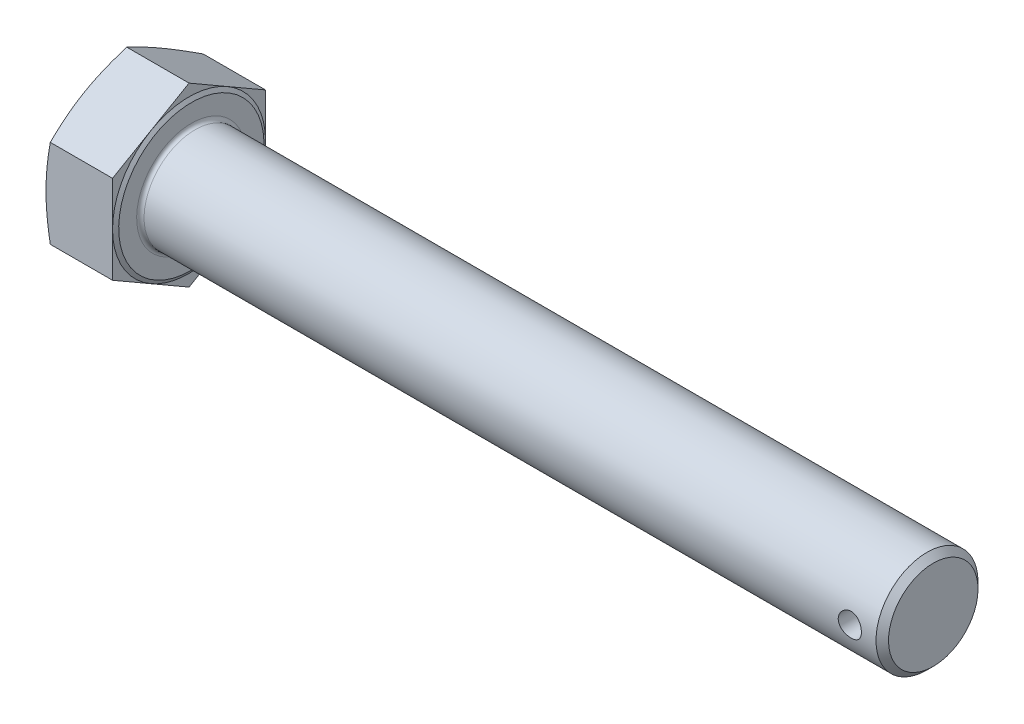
ISO-10303-21;
HEADER;
FILE_DESCRIPTION(('STEP AP214'),'2;1');
FILE_NAME('part.step','',(''),(''),'','','');
FILE_SCHEMA(('AUTOMOTIVE_DESIGN { 1 0 10303 214 1 1 1 1 }'));
ENDSEC;
DATA;
#1=APPLICATION_CONTEXT('core data for automotive mechanical design processes');
#2=APPLICATION_PROTOCOL_DEFINITION('international standard','automotive_design',2000,#1);
#3=PRODUCT_CONTEXT('',#1,'mechanical');
#4=PRODUCT('Part','Part','',(#3));
#5=PRODUCT_RELATED_PRODUCT_CATEGORY('part','',(#4));
#6=PRODUCT_DEFINITION_FORMATION('','',#4);
#7=PRODUCT_DEFINITION_CONTEXT('part definition',#1,'design');
#8=PRODUCT_DEFINITION('design','',#6,#7);
#9=PRODUCT_DEFINITION_SHAPE('','',#8);
#10=(LENGTH_UNIT() NAMED_UNIT(*) SI_UNIT(.MILLI.,.METRE.));
#11=(NAMED_UNIT(*) PLANE_ANGLE_UNIT() SI_UNIT($,.RADIAN.));
#12=(NAMED_UNIT(*) SI_UNIT($,.STERADIAN.) SOLID_ANGLE_UNIT());
#13=UNCERTAINTY_MEASURE_WITH_UNIT(LENGTH_MEASURE(1.E-05),#10,'distance_accuracy_value','');
#14=(GEOMETRIC_REPRESENTATION_CONTEXT(3) GLOBAL_UNCERTAINTY_ASSIGNED_CONTEXT((#13)) GLOBAL_UNIT_ASSIGNED_CONTEXT((#10,
#11,#12)) REPRESENTATION_CONTEXT('',''));
#15=CARTESIAN_POINT('',(0.,0.,0.));
#16=DIRECTION('',(0.,0.,1.));
#17=DIRECTION('',(1.,0.,0.));
#18=AXIS2_PLACEMENT_3D('',#15,#16,#17);
#19=CARTESIAN_POINT('',(14.85,0.,0.));
#20=DIRECTION('',(-1.,0.,0.));
#21=DIRECTION('',(0.,-1.,0.));
#22=AXIS2_PLACEMENT_3D('',#19,#20,#21);
#23=PLANE('',#22);
#24=CARTESIAN_POINT('',(14.85,0.,0.));
#25=DIRECTION('',(-1.,0.,0.));
#26=DIRECTION('',(0.,-1.,0.));
#27=AXIS2_PLACEMENT_3D('',#24,#25,#26);
#28=CIRCLE('',#27,11.8);
#29=CARTESIAN_POINT('',(14.85,-11.8,0.));
#30=VERTEX_POINT('',#29);
#31=EDGE_CURVE('E11',#30,#30,#28,.T.);
#32=ORIENTED_EDGE('',*,*,#31,.T.);
#33=EDGE_LOOP('',(#32));
#34=FACE_BOUND('',#33,.T.);
#35=CARTESIAN_POINT('',(14.85,0.,0.));
#36=DIRECTION('',(-1.,0.,0.));
#37=DIRECTION('',(0.,-1.,0.));
#38=AXIS2_PLACEMENT_3D('',#35,#36,#37);
#39=CIRCLE('',#38,15.675);
#40=CARTESIAN_POINT('',(14.85,-15.675,0.));
#41=VERTEX_POINT('',#40);
#42=EDGE_CURVE('E145',#41,#41,#39,.T.);
#43=ORIENTED_EDGE('',*,*,#42,.F.);
#44=EDGE_LOOP('',(#43));
#45=FACE_BOUND('',#44,.T.);
#46=ADVANCED_FACE('F32',(#34,#45),#23,.F.);
#47=CARTESIAN_POINT('',(14.35,-28.5788383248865,-16.5));
#48=DIRECTION('',(1.,0.,0.));
#49=DIRECTION('',(0.,0.,-1.));
#50=AXIS2_PLACEMENT_3D('',#47,#48,#49);
#51=PLANE('',#50);
#52=DIRECTION('',(0.,-0.5,-0.866025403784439));
#53=VECTOR('',#52,1.);
#54=CARTESIAN_POINT('',(14.35,-9.52627944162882,16.5));
#55=LINE('',#54,#53);
#56=CARTESIAN_POINT('',(14.35,-9.52627944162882,16.5));
#57=VERTEX_POINT('',#56);
#58=CARTESIAN_POINT('',(14.35,-14.2894191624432,8.25));
#59=VERTEX_POINT('',#58);
#60=EDGE_CURVE('E144',#57,#59,#55,.T.);
#61=ORIENTED_EDGE('',*,*,#60,.T.);
#62=CARTESIAN_POINT('',(14.35,0.,0.));
#63=DIRECTION('',(-1.,0.,0.));
#64=DIRECTION('',(0.,-1.,0.));
#65=AXIS2_PLACEMENT_3D('',#62,#63,#64);
#66=CIRCLE('',#65,16.5);
#67=CARTESIAN_POINT('',(14.35,0.,16.5));
#68=VERTEX_POINT('',#67);
#69=EDGE_CURVE('E54',#59,#68,#66,.T.);
#70=ORIENTED_EDGE('',*,*,#69,.T.);
#71=DIRECTION('',(0.,-1.,0.));
#72=VECTOR('',#71,1.);
#73=CARTESIAN_POINT('',(14.35,9.52627944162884,16.5));
#74=LINE('',#73,#72);
#75=EDGE_CURVE('E141',#68,#57,#74,.T.);
#76=ORIENTED_EDGE('',*,*,#75,.T.);
#77=EDGE_LOOP('',(#61,#70,#76));
#78=FACE_BOUND('',#77,.T.);
#79=ADVANCED_FACE('F140',(#78),#51,.T.);
#80=CARTESIAN_POINT('',(14.35,9.52627944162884,16.5));
#81=VERTEX_POINT('',#80);
#82=EDGE_CURVE('E152',#81,#68,#74,.T.);
#83=ORIENTED_EDGE('',*,*,#82,.T.);
#84=CARTESIAN_POINT('',(14.35,14.2894191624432,8.25));
#85=VERTEX_POINT('',#84);
#86=EDGE_CURVE('E127',#68,#85,#66,.T.);
#87=ORIENTED_EDGE('',*,*,#86,.T.);
#88=DIRECTION('',(0.,-0.5,0.866025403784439));
#89=VECTOR('',#88,1.);
#90=CARTESIAN_POINT('',(14.35,19.0525588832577,0.));
#91=LINE('',#90,#89);
#92=EDGE_CURVE('E158',#85,#81,#91,.T.);
#93=ORIENTED_EDGE('',*,*,#92,.T.);
#94=EDGE_LOOP('',(#83,#87,#93));
#95=FACE_BOUND('',#94,.T.);
#96=ADVANCED_FACE('F157',(#95),#51,.T.);
#97=CARTESIAN_POINT('',(14.35,19.0525588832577,0.));
#98=VERTEX_POINT('',#97);
#99=EDGE_CURVE('E155',#98,#85,#91,.T.);
#100=ORIENTED_EDGE('',*,*,#99,.T.);
#101=CARTESIAN_POINT('',(14.35,14.2894191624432,-8.25));
#102=VERTEX_POINT('',#101);
#103=EDGE_CURVE('E131',#85,#102,#66,.T.);
#104=ORIENTED_EDGE('',*,*,#103,.T.);
#105=DIRECTION('',(0.,0.5,0.866025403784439));
#106=VECTOR('',#105,1.);
#107=CARTESIAN_POINT('',(14.35,9.52627944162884,-16.5));
#108=LINE('',#107,#106);
#109=EDGE_CURVE('E324',#102,#98,#108,.T.);
#110=ORIENTED_EDGE('',*,*,#109,.T.);
#111=EDGE_LOOP('',(#100,#104,#110));
#112=FACE_BOUND('',#111,.T.);
#113=ADVANCED_FACE('F336',(#112),#51,.T.);
#114=CARTESIAN_POINT('',(14.35,9.52627944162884,-16.5));
#115=VERTEX_POINT('',#114);
#116=EDGE_CURVE('E326',#115,#102,#108,.T.);
#117=ORIENTED_EDGE('',*,*,#116,.T.);
#118=CARTESIAN_POINT('',(14.35,0.,-16.5));
#119=VERTEX_POINT('',#118);
#120=EDGE_CURVE('E379',#102,#119,#66,.T.);
#121=ORIENTED_EDGE('',*,*,#120,.T.);
#122=DIRECTION('',(0.,1.,0.));
#123=VECTOR('',#122,1.);
#124=CARTESIAN_POINT('',(14.35,-9.52627944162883,-16.5));
#125=LINE('',#124,#123);
#126=EDGE_CURVE('E321',#119,#115,#125,.T.);
#127=ORIENTED_EDGE('',*,*,#126,.T.);
#128=EDGE_LOOP('',(#117,#121,#127));
#129=FACE_BOUND('',#128,.T.);
#130=ADVANCED_FACE('F380',(#129),#51,.T.);
#131=CARTESIAN_POINT('',(14.35,-9.52627944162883,-16.5));
#132=VERTEX_POINT('',#131);
#133=EDGE_CURVE('E319',#132,#119,#125,.T.);
#134=ORIENTED_EDGE('',*,*,#133,.T.);
#135=CARTESIAN_POINT('',(14.35,-14.2894191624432,-8.24999999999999));
#136=VERTEX_POINT('',#135);
#137=EDGE_CURVE('E363',#119,#136,#66,.T.);
#138=ORIENTED_EDGE('',*,*,#137,.T.);
#139=DIRECTION('',(0.,0.5,-0.866025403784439));
#140=VECTOR('',#139,1.);
#141=CARTESIAN_POINT('',(14.35,-19.0525588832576,0.));
#142=LINE('',#141,#140);
#143=EDGE_CURVE('E377',#136,#132,#142,.T.);
#144=ORIENTED_EDGE('',*,*,#143,.T.);
#145=EDGE_LOOP('',(#134,#138,#144));
#146=FACE_BOUND('',#145,.T.);
#147=ADVANCED_FACE('F378',(#146),#51,.T.);
#148=CARTESIAN_POINT('',(14.35,-19.0525588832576,0.));
#149=VERTEX_POINT('',#148);
#150=EDGE_CURVE('E327',#149,#136,#142,.T.);
#151=ORIENTED_EDGE('',*,*,#150,.T.);
#152=EDGE_CURVE('E146',#136,#59,#66,.T.);
#153=ORIENTED_EDGE('',*,*,#152,.T.);
#154=EDGE_CURVE('E372',#59,#149,#55,.T.);
#155=ORIENTED_EDGE('',*,*,#154,.T.);
#156=EDGE_LOOP('',(#151,#153,#155));
#157=FACE_BOUND('',#156,.T.);
#158=ADVANCED_FACE('F224',(#157),#51,.T.);
#159=CARTESIAN_POINT('',(14.35,-9.52627944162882,16.5));
#160=DIRECTION('',(0.,0.866025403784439,-0.5));
#161=DIRECTION('',(0.,0.5,0.866025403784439));
#162=AXIS2_PLACEMENT_3D('',#159,#160,#161);
#163=PLANE('',#162);
#164=CARTESIAN_POINT('',(0.929097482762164,-19.0526743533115,-0.000199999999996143));
#165=CARTESIAN_POINT('',(0.857296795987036,-18.8553899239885,0.341506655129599));
#166=CARTESIAN_POINT('',(0.788725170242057,-18.6578155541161,0.683715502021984));
#167=CARTESIAN_POINT('',(0.658750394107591,-18.2620600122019,1.36918420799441));
#168=CARTESIAN_POINT('',(0.597347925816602,-18.0638787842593,1.71244416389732));
#169=CARTESIAN_POINT('',(0.424900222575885,-17.4681663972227,2.74424828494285));
#170=CARTESIAN_POINT('',(0.325715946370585,-17.0697392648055,3.43434432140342));
#171=CARTESIAN_POINT('',(0.205175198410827,-16.4725985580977,4.46862236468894));
#172=CARTESIAN_POINT('',(0.169803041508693,-16.2745739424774,4.81161106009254));
#173=CARTESIAN_POINT('',(0.108718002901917,-15.8781549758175,5.49822885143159));
#174=CARTESIAN_POINT('',(0.0830047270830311,-15.6797606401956,5.84185792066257));
#175=CARTESIAN_POINT('',(0.0416866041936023,-15.2827766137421,6.5294544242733));
#176=CARTESIAN_POINT('',(0.0260782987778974,-15.0841870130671,6.87342170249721));
#177=CARTESIAN_POINT('',(0.00523501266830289,-14.6868713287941,7.56159265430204));
#178=CARTESIAN_POINT('',(0.,-14.4881452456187,7.90579632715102));
#179=CARTESIAN_POINT('',(0.,-14.0906930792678,8.59420367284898));
#180=CARTESIAN_POINT('',(0.00523501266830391,-13.8919669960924,8.93840734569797));
#181=CARTESIAN_POINT('',(0.026078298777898,-13.4946513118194,9.62657829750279));
#182=CARTESIAN_POINT('',(0.041686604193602,-13.2960617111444,9.97054557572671));
#183=CARTESIAN_POINT('',(0.0830047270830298,-12.8990776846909,10.6581420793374));
#184=CARTESIAN_POINT('',(0.108718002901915,-12.700683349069,11.0017711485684));
#185=CARTESIAN_POINT('',(0.169803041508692,-12.304264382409,11.6883889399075));
#186=CARTESIAN_POINT('',(0.205175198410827,-12.1062397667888,12.0313776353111));
#187=CARTESIAN_POINT('',(0.325715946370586,-11.5090990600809,13.0656556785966));
#188=CARTESIAN_POINT('',(0.424900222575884,-11.1106719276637,13.7557517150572));
#189=CARTESIAN_POINT('',(0.597347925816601,-10.5149595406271,14.7875558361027));
#190=CARTESIAN_POINT('',(0.658750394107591,-10.3167783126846,15.1308157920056));
#191=CARTESIAN_POINT('',(0.788725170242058,-9.92102277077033,15.816284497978));
#192=CARTESIAN_POINT('',(0.857296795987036,-9.72344840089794,16.1584933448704));
#193=CARTESIAN_POINT('',(0.929097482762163,-9.52616397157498,16.5002));
#194=B_SPLINE_CURVE_WITH_KNOTS('',3,(#164,#165,#166,#167,#168,#169,#170,#171,#172,#173,#174,
#175,#176,#177,#178,#179,#180,#181,#182,#183,#184,#185,#186,#187,#188,#189,#190,#191,#192,#193),
.UNSPECIFIED.,.F.,.F.,(4,2,2,2,2,2,2,2,2,2,2,2,2,2,4),(0.,1.20310984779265,2.40633407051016,
4.8144458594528,6.00722883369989,7.19996313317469,8.39228901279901,9.58461121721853,
10.776933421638,11.9692593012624,13.1619936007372,14.3547765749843,16.7628883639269,
17.9661125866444,19.1692224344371),.UNSPECIFIED.);
#195=CARTESIAN_POINT('',(0.92905545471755,-19.0525588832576,0.));
#196=VERTEX_POINT('',#195);
#197=CARTESIAN_POINT('',(0.,-14.2894191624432,8.24999999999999));
#198=VERTEX_POINT('',#197);
#199=EDGE_CURVE('E366',#196,#198,#194,.T.);
#200=ORIENTED_EDGE('',*,*,#199,.F.);
#201=DIRECTION('',(-1.,0.,0.));
#202=VECTOR('',#201,1.);
#203=CARTESIAN_POINT('',(14.35,-19.0525588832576,0.));
#204=LINE('',#203,#202);
#205=EDGE_CURVE('E175',#149,#196,#204,.T.);
#206=ORIENTED_EDGE('',*,*,#205,.F.);
#207=ORIENTED_EDGE('',*,*,#154,.F.);
#208=ORIENTED_EDGE('',*,*,#60,.F.);
#209=DIRECTION('',(-1.,0.,0.));
#210=VECTOR('',#209,1.);
#211=CARTESIAN_POINT('',(14.35,-9.52627944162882,16.5));
#212=LINE('',#211,#210);
#213=CARTESIAN_POINT('',(0.929055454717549,-9.52627944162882,16.5));
#214=VERTEX_POINT('',#213);
#215=EDGE_CURVE('E154',#57,#214,#212,.T.);
#216=ORIENTED_EDGE('',*,*,#215,.T.);
#217=EDGE_CURVE('E256',#198,#214,#194,.T.);
#218=ORIENTED_EDGE('',*,*,#217,.F.);
#219=EDGE_LOOP('',(#200,#206,#207,#208,#216,#218));
#220=FACE_BOUND('',#219,.T.);
#221=ADVANCED_FACE('F34',(#220),#163,.F.);
#222=CARTESIAN_POINT('',(14.35,-19.0525588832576,0.));
#223=DIRECTION('',(0.,0.866025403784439,0.5));
#224=DIRECTION('',(0.,-0.5,0.866025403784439));
#225=AXIS2_PLACEMENT_3D('',#222,#223,#224);
#226=PLANE('',#225);
#227=CARTESIAN_POINT('',(0.929097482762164,-9.52616397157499,-16.5002));
#228=CARTESIAN_POINT('',(0.857296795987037,-9.72344840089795,-16.1584933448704));
#229=CARTESIAN_POINT('',(0.788725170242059,-9.92102277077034,-15.816284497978));
#230=CARTESIAN_POINT('',(0.658750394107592,-10.3167783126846,-15.1308157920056));
#231=CARTESIAN_POINT('',(0.597347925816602,-10.5149595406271,-14.7875558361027));
#232=CARTESIAN_POINT('',(0.424900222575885,-11.1106719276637,-13.7557517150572));
#233=CARTESIAN_POINT('',(0.325715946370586,-11.5090990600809,-13.0656556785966));
#234=CARTESIAN_POINT('',(0.205175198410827,-12.1062397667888,-12.0313776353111));
#235=CARTESIAN_POINT('',(0.169803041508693,-12.304264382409,-11.6883889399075));
#236=CARTESIAN_POINT('',(0.108718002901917,-12.700683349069,-11.0017711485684));
#237=CARTESIAN_POINT('',(0.0830047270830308,-12.8990776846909,-10.6581420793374));
#238=CARTESIAN_POINT('',(0.0416866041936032,-13.2960617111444,-9.97054557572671));
#239=CARTESIAN_POINT('',(0.0260782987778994,-13.4946513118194,-9.62657829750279));
#240=CARTESIAN_POINT('',(0.00523501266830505,-13.8919669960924,-8.93840734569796));
#241=CARTESIAN_POINT('',(0.,-14.0906930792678,-8.59420367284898));
#242=CARTESIAN_POINT('',(0.,-14.4881452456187,-7.90579632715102));
#243=CARTESIAN_POINT('',(0.00523501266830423,-14.6868713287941,-7.56159265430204));
#244=CARTESIAN_POINT('',(0.0260782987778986,-15.0841870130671,-6.87342170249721));
#245=CARTESIAN_POINT('',(0.0416866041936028,-15.2827766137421,-6.52945442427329));
#246=CARTESIAN_POINT('',(0.0830047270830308,-15.6797606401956,-5.84185792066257));
#247=CARTESIAN_POINT('',(0.108718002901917,-15.8781549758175,-5.49822885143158));
#248=CARTESIAN_POINT('',(0.169803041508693,-16.2745739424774,-4.81161106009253));
#249=CARTESIAN_POINT('',(0.205175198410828,-16.4725985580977,-4.46862236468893));
#250=CARTESIAN_POINT('',(0.325715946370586,-17.0697392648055,-3.43434432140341));
#251=CARTESIAN_POINT('',(0.424900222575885,-17.4681663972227,-2.74424828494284));
#252=CARTESIAN_POINT('',(0.597347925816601,-18.0638787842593,-1.71244416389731));
#253=CARTESIAN_POINT('',(0.658750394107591,-18.2620600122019,-1.3691842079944));
#254=CARTESIAN_POINT('',(0.788725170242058,-18.6578155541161,-0.683715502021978));
#255=CARTESIAN_POINT('',(0.857296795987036,-18.8553899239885,-0.341506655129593));
#256=CARTESIAN_POINT('',(0.929097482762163,-19.0526743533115,0.000200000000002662));
#257=B_SPLINE_CURVE_WITH_KNOTS('',3,(#227,#228,#229,#230,#231,#232,#233,#234,#235,#236,#237,
#238,#239,#240,#241,#242,#243,#244,#245,#246,#247,#248,#249,#250,#251,#252,#253,#254,#255,#256),
.UNSPECIFIED.,.F.,.F.,(4,2,2,2,2,2,2,2,2,2,2,2,2,2,4),(0.,1.20310984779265,2.40633407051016,
4.8144458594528,6.00722883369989,7.19996313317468,8.39228901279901,9.58461121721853,
10.776933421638,11.9692593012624,13.1619936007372,14.3547765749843,16.7628883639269,
17.9661125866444,19.1692224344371),.UNSPECIFIED.);
#258=CARTESIAN_POINT('',(0.929055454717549,-9.52627944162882,-16.5));
#259=VERTEX_POINT('',#258);
#260=CARTESIAN_POINT('',(0.,-14.2894191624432,-8.24999999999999));
#261=VERTEX_POINT('',#260);
#262=EDGE_CURVE('E270',#259,#261,#257,.T.);
#263=ORIENTED_EDGE('',*,*,#262,.F.);
#264=DIRECTION('',(-1.,0.,0.));
#265=VECTOR('',#264,1.);
#266=CARTESIAN_POINT('',(14.35,-9.52627944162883,-16.5));
#267=LINE('',#266,#265);
#268=EDGE_CURVE('E172',#132,#259,#267,.T.);
#269=ORIENTED_EDGE('',*,*,#268,.F.);
#270=ORIENTED_EDGE('',*,*,#143,.F.);
#271=ORIENTED_EDGE('',*,*,#150,.F.);
#272=ORIENTED_EDGE('',*,*,#205,.T.);
#273=EDGE_CURVE('E266',#261,#196,#257,.T.);
#274=ORIENTED_EDGE('',*,*,#273,.F.);
#275=EDGE_LOOP('',(#263,#269,#270,#271,#272,#274));
#276=FACE_BOUND('',#275,.T.);
#277=ADVANCED_FACE('F277',(#276),#226,.F.);
#278=CARTESIAN_POINT('',(14.35,-9.52627944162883,-16.5));
#279=DIRECTION('',(0.,0.,1.));
#280=DIRECTION('',(1.,0.,0.));
#281=AXIS2_PLACEMENT_3D('',#278,#279,#280);
#282=PLANE('',#281);
#283=CARTESIAN_POINT('',(4.96450390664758,-25.2222382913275,-16.5));
#284=CARTESIAN_POINT('',(4.8508186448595,-24.8489839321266,-16.5));
#285=CARTESIAN_POINT('',(4.73782089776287,-24.4755202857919,-16.5));
#286=CARTESIAN_POINT('',(4.51335434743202,-23.7281315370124,-16.5));
#287=CARTESIAN_POINT('',(4.40188555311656,-23.3542064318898,-16.5));
#288=CARTESIAN_POINT('',(4.06998909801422,-22.2316258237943,-16.5));
#289=CARTESIAN_POINT('',(3.85208821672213,-21.4822201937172,-16.5));
#290=CARTESIAN_POINT('',(3.42417782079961,-19.9796417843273,-16.5));
#291=CARTESIAN_POINT('',(3.21418378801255,-19.2264645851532,-16.5));
#292=CARTESIAN_POINT('',(2.80452755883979,-17.7173088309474,-16.5));
#293=CARTESIAN_POINT('',(2.60486517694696,-16.961330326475,-16.5));
#294=CARTESIAN_POINT('',(2.22081902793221,-15.4554094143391,-16.5));
#295=CARTESIAN_POINT('',(2.0362772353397,-14.7055075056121,-16.5));
#296=CARTESIAN_POINT('',(1.68290492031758,-13.201972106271,-16.5));
#297=CARTESIAN_POINT('',(1.51407466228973,-12.4483385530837,-16.5));
#298=CARTESIAN_POINT('',(1.19606187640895,-10.9371711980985,-16.5));
#299=CARTESIAN_POINT('',(1.04687264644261,-10.1796388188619,-16.5));
#300=CARTESIAN_POINT('',(0.77268459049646,-8.66017606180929,-16.5));
#301=CARTESIAN_POINT('',(0.647684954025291,-7.89824583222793,-16.5));
#302=CARTESIAN_POINT('',(0.439330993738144,-6.45578370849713,-16.5));
#303=CARTESIAN_POINT('',(0.352878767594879,-5.77570349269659,-16.5));
#304=CARTESIAN_POINT('',(0.206535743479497,-4.41266734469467,-16.5));
#305=CARTESIAN_POINT('',(0.14664417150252,-3.72971149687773,-16.5));
#306=CARTESIAN_POINT('',(0.0563067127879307,-2.36230937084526,-16.5));
#307=CARTESIAN_POINT('',(0.0258399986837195,-1.67786449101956,-16.5));
#308=CARTESIAN_POINT('',(-0.00410522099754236,-0.308289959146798,-16.5));
#309=CARTESIAN_POINT('',(-0.00358394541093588,0.376839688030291,-16.5));
#310=CARTESIAN_POINT('',(0.0284996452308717,1.74983625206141,-16.5));
#311=CARTESIAN_POINT('',(0.0602193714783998,2.43769942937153,-16.5));
#312=CARTESIAN_POINT('',(0.153240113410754,3.81140535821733,-16.5));
#313=CARTESIAN_POINT('',(0.214541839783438,4.49724806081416,-16.5));
#314=CARTESIAN_POINT('',(0.36385891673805,5.86657438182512,-16.5));
#315=CARTESIAN_POINT('',(0.451897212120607,6.55005546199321,-16.5));
#316=CARTESIAN_POINT('',(0.651116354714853,7.91359833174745,-16.5));
#317=CARTESIAN_POINT('',(0.76229732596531,8.59366010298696,-16.5));
#318=CARTESIAN_POINT('',(1.01058110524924,9.98615039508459,-16.5));
#319=CARTESIAN_POINT('',(1.1487439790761,10.6983882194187,-16.5));
#320=CARTESIAN_POINT('',(1.4428521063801,12.1192063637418,-16.5));
#321=CARTESIAN_POINT('',(1.59879870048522,12.8277864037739,-16.5));
#322=CARTESIAN_POINT('',(1.92519971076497,14.2417939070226,-16.5));
#323=CARTESIAN_POINT('',(2.09565834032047,14.9472203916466,-16.5));
#324=CARTESIAN_POINT('',(2.44831056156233,16.3551017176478,-16.5));
#325=CARTESIAN_POINT('',(2.63050387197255,17.0575566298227,-16.5));
#326=CARTESIAN_POINT('',(3.00467207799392,18.4608135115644,-16.5));
#327=CARTESIAN_POINT('',(3.19665923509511,19.1616121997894,-16.5));
#328=CARTESIAN_POINT('',(3.58844340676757,20.5610201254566,-16.5));
#329=CARTESIAN_POINT('',(3.78824045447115,21.2596293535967,-16.5));
#330=CARTESIAN_POINT('',(4.19421484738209,22.6548603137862,-16.5));
#331=CARTESIAN_POINT('',(4.40039111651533,23.3514823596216,-16.5));
#332=CARTESIAN_POINT('',(4.818047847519,24.7431302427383,-16.5));
#333=CARTESIAN_POINT('',(5.02952829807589,25.4381560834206,-16.5));
#334=CARTESIAN_POINT('',(5.45454897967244,26.8191789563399,-16.5));
#335=CARTESIAN_POINT('',(5.66804068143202,27.5051909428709,-16.5));
#336=CARTESIAN_POINT('',(6.09866542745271,28.8760718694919,-16.5));
#337=CARTESIAN_POINT('',(6.31579848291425,29.5609408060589,-16.5));
#338=CARTESIAN_POINT('',(6.97181459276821,31.6141379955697,-16.5));
#339=CARTESIAN_POINT('',(7.41529632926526,32.980997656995,-16.5));
#340=CARTESIAN_POINT('',(8.08638638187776,35.0264823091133,-16.5));
#341=CARTESIAN_POINT('',(8.31062765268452,35.706217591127,-16.5));
#342=CARTESIAN_POINT('',(8.76104960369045,37.0650463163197,-16.5));
#343=CARTESIAN_POINT('',(8.98723028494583,37.744139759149,-16.5));
#344=CARTESIAN_POINT('',(9.44125199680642,39.1017090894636,-16.5));
#345=CARTESIAN_POINT('',(9.66909288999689,39.7801850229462,-16.5));
#346=CARTESIAN_POINT('',(10.1262489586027,41.1366382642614,-16.5));
#347=CARTESIAN_POINT('',(10.3555641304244,41.8146155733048,-16.5));
#348=CARTESIAN_POINT('',(10.5855148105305,42.4923768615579,-16.5));
#349=B_SPLINE_CURVE_WITH_KNOTS('',3,(#283,#284,#285,#286,#287,#288,#289,#290,#291,#292,#293,
#294,#295,#296,#297,#298,#299,#300,#301,#302,#303,#304,#305,#306,#307,#308,#309,#310,#311,#312,
#313,#314,#315,#316,#317,#318,#319,#320,#321,#322,#323,#324,#325,#326,#327,#328,#329,#330,#331,
#332,#333,#334,#335,#336,#337,#338,#339,#340,#341,#342,#343,#344,#345,#346,#347,#348),
.UNSPECIFIED.,.F.,.F.,(4,2,2,2,2,2,2,2,2,2,2,2,2,2,2,2,2,2,2,2,2,2,2,2,2,2,2,2,2,2,2,2,4),(0.,
1.17054922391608,2.34110527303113,4.68239041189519,7.02804380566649,9.37365506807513,
11.6903461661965,14.0070762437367,16.3230137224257,18.6388735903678,20.6950814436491,
22.7512293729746,24.8059208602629,26.8605978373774,28.925695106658,30.9908419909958,
33.0577661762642,35.1247014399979,37.3009674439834,39.4773976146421,41.6544618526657,
43.8314739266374,46.0112818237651,48.1910989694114,50.3705503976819,52.5499971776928,
54.7053784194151,56.8607662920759,61.1717272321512,63.3190307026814,65.4663353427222,
67.6134642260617,69.7605878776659),.UNSPECIFIED.);
#350=CARTESIAN_POINT('',(0.929055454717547,9.52627944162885,-16.5));
#351=VERTEX_POINT('',#350);
#352=CARTESIAN_POINT('',(0.,0.,-16.5));
#353=VERTEX_POINT('',#352);
#354=EDGE_CURVE('E311',#351,#353,#349,.F.);
#355=ORIENTED_EDGE('',*,*,#354,.F.);
#356=DIRECTION('',(-1.,0.,0.));
#357=VECTOR('',#356,1.);
#358=CARTESIAN_POINT('',(14.35,9.52627944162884,-16.5));
#359=LINE('',#358,#357);
#360=EDGE_CURVE('E169',#115,#351,#359,.T.);
#361=ORIENTED_EDGE('',*,*,#360,.F.);
#362=ORIENTED_EDGE('',*,*,#126,.F.);
#363=ORIENTED_EDGE('',*,*,#133,.F.);
#364=ORIENTED_EDGE('',*,*,#268,.T.);
#365=EDGE_CURVE('E271',#353,#259,#349,.F.);
#366=ORIENTED_EDGE('',*,*,#365,.F.);
#367=EDGE_LOOP('',(#355,#361,#362,#363,#364,#366));
#368=FACE_BOUND('',#367,.T.);
#369=ADVANCED_FACE('F280',(#368),#282,.F.);
#370=CARTESIAN_POINT('',(14.35,9.52627944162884,-16.5));
#371=DIRECTION('',(0.,-0.866025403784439,0.5));
#372=DIRECTION('',(0.,-0.5,-0.866025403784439));
#373=AXIS2_PLACEMENT_3D('',#370,#371,#372);
#374=PLANE('',#373);
#375=CARTESIAN_POINT('',(0.92909748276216,19.0526743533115,0.000199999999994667));
#376=CARTESIAN_POINT('',(0.857296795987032,18.8553899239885,-0.341506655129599));
#377=CARTESIAN_POINT('',(0.788725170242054,18.6578155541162,-0.683715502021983));
#378=CARTESIAN_POINT('',(0.658750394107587,18.2620600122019,-1.36918420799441));
#379=CARTESIAN_POINT('',(0.597347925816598,18.0638787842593,-1.71244416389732));
#380=CARTESIAN_POINT('',(0.424900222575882,17.4681663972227,-2.74424828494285));
#381=CARTESIAN_POINT('',(0.325715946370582,17.0697392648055,-3.43434432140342));
#382=CARTESIAN_POINT('',(0.205175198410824,16.4725985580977,-4.46862236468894));
#383=CARTESIAN_POINT('',(0.16980304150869,16.2745739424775,-4.81161106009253));
#384=CARTESIAN_POINT('',(0.108718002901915,15.8781549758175,-5.49822885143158));
#385=CARTESIAN_POINT('',(0.0830047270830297,15.6797606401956,-5.84185792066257));
#386=CARTESIAN_POINT('',(0.0416866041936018,15.2827766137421,-6.52945442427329));
#387=CARTESIAN_POINT('',(0.0260782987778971,15.0841870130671,-6.87342170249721));
#388=CARTESIAN_POINT('',(0.00523501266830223,14.6868713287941,-7.56159265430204));
#389=CARTESIAN_POINT('',(0.,14.4881452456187,-7.90579632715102));
#390=CARTESIAN_POINT('',(0.,14.0906930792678,-8.59420367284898));
#391=CARTESIAN_POINT('',(0.00523501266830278,13.8919669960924,-8.93840734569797));
#392=CARTESIAN_POINT('',(0.0260782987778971,13.4946513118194,-9.62657829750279));
#393=CARTESIAN_POINT('',(0.041686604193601,13.2960617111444,-9.97054557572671));
#394=CARTESIAN_POINT('',(0.0830047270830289,12.8990776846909,-10.6581420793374));
#395=CARTESIAN_POINT('',(0.108718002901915,12.700683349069,-11.0017711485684));
#396=CARTESIAN_POINT('',(0.169803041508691,12.304264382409,-11.6883889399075));
#397=CARTESIAN_POINT('',(0.205175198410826,12.1062397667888,-12.0313776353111));
#398=CARTESIAN_POINT('',(0.325715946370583,11.509099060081,-13.0656556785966));
#399=CARTESIAN_POINT('',(0.424900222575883,11.1106719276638,-13.7557517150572));
#400=CARTESIAN_POINT('',(0.5973479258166,10.5149595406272,-14.7875558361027));
#401=CARTESIAN_POINT('',(0.65875039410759,10.3167783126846,-15.1308157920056));
#402=CARTESIAN_POINT('',(0.788725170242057,9.92102277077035,-15.816284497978));
#403=CARTESIAN_POINT('',(0.857296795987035,9.72344840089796,-16.1584933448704));
#404=CARTESIAN_POINT('',(0.929097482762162,9.526163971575,-16.5002));
#405=B_SPLINE_CURVE_WITH_KNOTS('',3,(#375,#376,#377,#378,#379,#380,#381,#382,#383,#384,#385,
#386,#387,#388,#389,#390,#391,#392,#393,#394,#395,#396,#397,#398,#399,#400,#401,#402,#403,#404),
.UNSPECIFIED.,.F.,.F.,(4,2,2,2,2,2,2,2,2,2,2,2,2,2,4),(0.,1.20310984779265,2.40633407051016,
4.8144458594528,6.00722883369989,7.19996313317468,8.39228901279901,9.58461121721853,
10.776933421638,11.9692593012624,13.1619936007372,14.3547765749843,16.7628883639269,
17.9661125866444,19.1692224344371),.UNSPECIFIED.);
#406=CARTESIAN_POINT('',(0.929055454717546,19.0525588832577,0.));
#407=VERTEX_POINT('',#406);
#408=CARTESIAN_POINT('',(0.,14.2894191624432,-8.25));
#409=VERTEX_POINT('',#408);
#410=EDGE_CURVE('E62',#407,#409,#405,.T.);
#411=ORIENTED_EDGE('',*,*,#410,.F.);
#412=DIRECTION('',(-1.,0.,0.));
#413=VECTOR('',#412,1.);
#414=CARTESIAN_POINT('',(14.35,19.0525588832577,0.));
#415=LINE('',#414,#413);
#416=EDGE_CURVE('E166',#98,#407,#415,.T.);
#417=ORIENTED_EDGE('',*,*,#416,.F.);
#418=ORIENTED_EDGE('',*,*,#109,.F.);
#419=ORIENTED_EDGE('',*,*,#116,.F.);
#420=ORIENTED_EDGE('',*,*,#360,.T.);
#421=EDGE_CURVE('E312',#409,#351,#405,.T.);
#422=ORIENTED_EDGE('',*,*,#421,.F.);
#423=EDGE_LOOP('',(#411,#417,#418,#419,#420,#422));
#424=FACE_BOUND('',#423,.T.);
#425=ADVANCED_FACE('F284',(#424),#374,.F.);
#426=CARTESIAN_POINT('',(14.35,19.0525588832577,0.));
#427=DIRECTION('',(0.,-0.866025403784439,-0.5));
#428=DIRECTION('',(0.,0.5,-0.866025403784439));
#429=AXIS2_PLACEMENT_3D('',#426,#427,#428);
#430=PLANE('',#429);
#431=CARTESIAN_POINT('',(0.929097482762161,9.526163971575,16.5002));
#432=CARTESIAN_POINT('',(0.857296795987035,9.72344840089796,16.1584933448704));
#433=CARTESIAN_POINT('',(0.788725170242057,9.92102277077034,15.816284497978));
#434=CARTESIAN_POINT('',(0.658750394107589,10.3167783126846,15.1308157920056));
#435=CARTESIAN_POINT('',(0.597347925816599,10.5149595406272,14.7875558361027));
#436=CARTESIAN_POINT('',(0.424900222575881,11.1106719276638,13.7557517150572));
#437=CARTESIAN_POINT('',(0.325715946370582,11.509099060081,13.0656556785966));
#438=CARTESIAN_POINT('',(0.205175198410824,12.1062397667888,12.0313776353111));
#439=CARTESIAN_POINT('',(0.169803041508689,12.304264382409,11.6883889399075));
#440=CARTESIAN_POINT('',(0.108718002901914,12.700683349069,11.0017711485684));
#441=CARTESIAN_POINT('',(0.0830047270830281,12.8990776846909,10.6581420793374));
#442=CARTESIAN_POINT('',(0.0416866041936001,13.2960617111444,9.97054557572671));
#443=CARTESIAN_POINT('',(0.0260782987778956,13.4946513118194,9.62657829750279));
#444=CARTESIAN_POINT('',(0.0052350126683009,13.8919669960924,8.93840734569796));
#445=CARTESIAN_POINT('',(0.,14.0906930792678,8.59420367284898));
#446=CARTESIAN_POINT('',(0.,14.4881452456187,7.90579632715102));
#447=CARTESIAN_POINT('',(0.00523501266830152,14.6868713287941,7.56159265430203));
#448=CARTESIAN_POINT('',(0.0260782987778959,15.0841870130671,6.87342170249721));
#449=CARTESIAN_POINT('',(0.0416866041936,15.2827766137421,6.52945442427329));
#450=CARTESIAN_POINT('',(0.0830047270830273,15.6797606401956,5.84185792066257));
#451=CARTESIAN_POINT('',(0.108718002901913,15.8781549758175,5.49822885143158));
#452=CARTESIAN_POINT('',(0.169803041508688,16.2745739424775,4.81161106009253));
#453=CARTESIAN_POINT('',(0.205175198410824,16.4725985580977,4.46862236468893));
#454=CARTESIAN_POINT('',(0.325715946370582,17.0697392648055,3.43434432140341));
#455=CARTESIAN_POINT('',(0.424900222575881,17.4681663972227,2.74424828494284));
#456=CARTESIAN_POINT('',(0.597347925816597,18.0638787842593,1.71244416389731));
#457=CARTESIAN_POINT('',(0.658750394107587,18.2620600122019,1.3691842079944));
#458=CARTESIAN_POINT('',(0.788725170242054,18.6578155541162,0.683715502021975));
#459=CARTESIAN_POINT('',(0.857296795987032,18.8553899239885,0.34150665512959));
#460=CARTESIAN_POINT('',(0.929097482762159,19.0526743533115,-0.000200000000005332));
#461=B_SPLINE_CURVE_WITH_KNOTS('',3,(#431,#432,#433,#434,#435,#436,#437,#438,#439,#440,#441,
#442,#443,#444,#445,#446,#447,#448,#449,#450,#451,#452,#453,#454,#455,#456,#457,#458,#459,#460),
.UNSPECIFIED.,.F.,.F.,(4,2,2,2,2,2,2,2,2,2,2,2,2,2,4),(0.,1.20310984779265,2.40633407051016,
4.81444585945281,6.00722883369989,7.19996313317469,8.39228901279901,9.58461121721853,
10.7769334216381,11.9692593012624,13.1619936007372,14.3547765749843,16.7628883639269,
17.9661125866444,19.1692224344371),.UNSPECIFIED.);
#462=CARTESIAN_POINT('',(0.929055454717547,9.52627944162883,16.5));
#463=VERTEX_POINT('',#462);
#464=CARTESIAN_POINT('',(0.,14.2894191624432,8.24999999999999));
#465=VERTEX_POINT('',#464);
#466=EDGE_CURVE('E249',#463,#465,#461,.T.);
#467=ORIENTED_EDGE('',*,*,#466,.F.);
#468=DIRECTION('',(-1.,0.,0.));
#469=VECTOR('',#468,1.);
#470=CARTESIAN_POINT('',(14.35,9.52627944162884,16.5));
#471=LINE('',#470,#469);
#472=EDGE_CURVE('E160',#81,#463,#471,.T.);
#473=ORIENTED_EDGE('',*,*,#472,.F.);
#474=ORIENTED_EDGE('',*,*,#92,.F.);
#475=ORIENTED_EDGE('',*,*,#99,.F.);
#476=ORIENTED_EDGE('',*,*,#416,.T.);
#477=EDGE_CURVE('E371',#465,#407,#461,.T.);
#478=ORIENTED_EDGE('',*,*,#477,.F.);
#479=EDGE_LOOP('',(#467,#473,#474,#475,#476,#478));
#480=FACE_BOUND('',#479,.T.);
#481=ADVANCED_FACE('F288',(#480),#430,.F.);
#482=CARTESIAN_POINT('',(14.35,9.52627944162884,16.5));
#483=DIRECTION('',(0.,0.,-1.));
#484=DIRECTION('',(-1.,0.,0.));
#485=AXIS2_PLACEMENT_3D('',#482,#483,#484);
#486=PLANE('',#485);
#487=CARTESIAN_POINT('',(4.96450390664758,-25.2222382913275,16.5));
#488=CARTESIAN_POINT('',(4.8508186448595,-24.8489839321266,16.5));
#489=CARTESIAN_POINT('',(4.73782089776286,-24.4755202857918,16.5));
#490=CARTESIAN_POINT('',(4.51335434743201,-23.7281315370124,16.5));
#491=CARTESIAN_POINT('',(4.40188555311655,-23.3542064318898,16.5));
#492=CARTESIAN_POINT('',(4.06998909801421,-22.2316258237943,16.5));
#493=CARTESIAN_POINT('',(3.85208821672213,-21.4822201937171,16.5));
#494=CARTESIAN_POINT('',(3.42417782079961,-19.9796417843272,16.5));
#495=CARTESIAN_POINT('',(3.21418378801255,-19.2264645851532,16.5));
#496=CARTESIAN_POINT('',(2.80452755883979,-17.7173088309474,16.5));
#497=CARTESIAN_POINT('',(2.60486517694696,-16.961330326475,16.5));
#498=CARTESIAN_POINT('',(2.22081902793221,-15.4554094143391,16.5));
#499=CARTESIAN_POINT('',(2.0362772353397,-14.7055075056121,16.5));
#500=CARTESIAN_POINT('',(1.68290492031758,-13.201972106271,16.5));
#501=CARTESIAN_POINT('',(1.51407466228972,-12.4483385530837,16.5));
#502=CARTESIAN_POINT('',(1.19606187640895,-10.9371711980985,16.5));
#503=CARTESIAN_POINT('',(1.04687264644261,-10.1796388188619,16.5));
#504=CARTESIAN_POINT('',(0.772684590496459,-8.66017606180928,16.5));
#505=CARTESIAN_POINT('',(0.64768495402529,-7.89824583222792,16.5));
#506=CARTESIAN_POINT('',(0.439330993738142,-6.45578370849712,16.5));
#507=CARTESIAN_POINT('',(0.352878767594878,-5.77570349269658,16.5));
#508=CARTESIAN_POINT('',(0.206535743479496,-4.41266734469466,16.5));
#509=CARTESIAN_POINT('',(0.14664417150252,-3.72971149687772,16.5));
#510=CARTESIAN_POINT('',(0.0563067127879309,-2.36230937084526,16.5));
#511=CARTESIAN_POINT('',(0.0258399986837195,-1.67786449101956,16.5));
#512=CARTESIAN_POINT('',(-0.00410522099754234,-0.308289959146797,16.5));
#513=CARTESIAN_POINT('',(-0.00358394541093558,0.376839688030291,16.5));
#514=CARTESIAN_POINT('',(0.0284996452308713,1.74983625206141,16.5));
#515=CARTESIAN_POINT('',(0.0602193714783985,2.43769942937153,16.5));
#516=CARTESIAN_POINT('',(0.153240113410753,3.81140535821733,16.5));
#517=CARTESIAN_POINT('',(0.214541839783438,4.49724806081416,16.5));
#518=CARTESIAN_POINT('',(0.36385891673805,5.86657438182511,16.5));
#519=CARTESIAN_POINT('',(0.451897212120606,6.55005546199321,16.5));
#520=CARTESIAN_POINT('',(0.651116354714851,7.91359833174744,16.5));
#521=CARTESIAN_POINT('',(0.762297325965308,8.59366010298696,16.5));
#522=CARTESIAN_POINT('',(1.01058110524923,9.98615039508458,16.5));
#523=CARTESIAN_POINT('',(1.1487439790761,10.6983882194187,16.5));
#524=CARTESIAN_POINT('',(1.44285210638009,12.1192063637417,16.5));
#525=CARTESIAN_POINT('',(1.59879870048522,12.8277864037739,16.5));
#526=CARTESIAN_POINT('',(1.92519971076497,14.2417939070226,16.5));
#527=CARTESIAN_POINT('',(2.09565834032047,14.9472203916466,16.5));
#528=CARTESIAN_POINT('',(2.44831056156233,16.3551017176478,16.5));
#529=CARTESIAN_POINT('',(2.63050387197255,17.0575566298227,16.5));
#530=CARTESIAN_POINT('',(3.00467207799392,18.4608135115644,16.5));
#531=CARTESIAN_POINT('',(3.19665923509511,19.1616121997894,16.5));
#532=CARTESIAN_POINT('',(3.58844340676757,20.5610201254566,16.5));
#533=CARTESIAN_POINT('',(3.78824045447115,21.2596293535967,16.5));
#534=CARTESIAN_POINT('',(4.19421484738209,22.6548603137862,16.5));
#535=CARTESIAN_POINT('',(4.40039111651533,23.3514823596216,16.5));
#536=CARTESIAN_POINT('',(4.818047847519,24.7431302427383,16.5));
#537=CARTESIAN_POINT('',(5.02952829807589,25.4381560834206,16.5));
#538=CARTESIAN_POINT('',(5.45454897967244,26.8191789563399,16.5));
#539=CARTESIAN_POINT('',(5.66804068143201,27.5051909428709,16.5));
#540=CARTESIAN_POINT('',(6.09866542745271,28.8760718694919,16.5));
#541=CARTESIAN_POINT('',(6.31579848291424,29.5609408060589,16.5));
#542=CARTESIAN_POINT('',(6.9718145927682,31.6141379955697,16.5));
#543=CARTESIAN_POINT('',(7.41529632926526,32.980997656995,16.5));
#544=CARTESIAN_POINT('',(8.08638638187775,35.0264823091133,16.5));
#545=CARTESIAN_POINT('',(8.31062765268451,35.706217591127,16.5));
#546=CARTESIAN_POINT('',(8.76104960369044,37.0650463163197,16.5));
#547=CARTESIAN_POINT('',(8.98723028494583,37.744139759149,16.5));
#548=CARTESIAN_POINT('',(9.44125199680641,39.1017090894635,16.5));
#549=CARTESIAN_POINT('',(9.66909288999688,39.7801850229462,16.5));
#550=CARTESIAN_POINT('',(10.1262489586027,41.1366382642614,16.5));
#551=CARTESIAN_POINT('',(10.3555641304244,41.8146155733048,16.5));
#552=CARTESIAN_POINT('',(10.5855148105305,42.4923768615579,16.5));
#553=B_SPLINE_CURVE_WITH_KNOTS('',3,(#487,#488,#489,#490,#491,#492,#493,#494,#495,#496,#497,
#498,#499,#500,#501,#502,#503,#504,#505,#506,#507,#508,#509,#510,#511,#512,#513,#514,#515,#516,
#517,#518,#519,#520,#521,#522,#523,#524,#525,#526,#527,#528,#529,#530,#531,#532,#533,#534,#535,
#536,#537,#538,#539,#540,#541,#542,#543,#544,#545,#546,#547,#548,#549,#550,#551,#552),
.UNSPECIFIED.,.F.,.F.,(4,2,2,2,2,2,2,2,2,2,2,2,2,2,2,2,2,2,2,2,2,2,2,2,2,2,2,2,2,2,2,2,4),(0.,
1.17054922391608,2.34110527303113,4.68239041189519,7.02804380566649,9.37365506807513,
11.6903461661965,14.0070762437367,16.3230137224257,18.6388735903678,20.6950814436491,
22.7512293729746,24.8059208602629,26.8605978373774,28.925695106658,30.9908419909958,
33.0577661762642,35.1247014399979,37.3009674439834,39.4773976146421,41.6544618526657,
43.8314739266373,46.0112818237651,48.1910989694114,50.3705503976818,52.5499971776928,
54.7053784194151,56.8607662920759,61.1717272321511,63.3190307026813,65.4663353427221,
67.6134642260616,69.7605878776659),.UNSPECIFIED.);
#554=CARTESIAN_POINT('',(0.,0.,16.5));
#555=VERTEX_POINT('',#554);
#556=EDGE_CURVE('E343',#214,#555,#553,.T.);
#557=ORIENTED_EDGE('',*,*,#556,.F.);
#558=ORIENTED_EDGE('',*,*,#215,.F.);
#559=ORIENTED_EDGE('',*,*,#75,.F.);
#560=ORIENTED_EDGE('',*,*,#82,.F.);
#561=ORIENTED_EDGE('',*,*,#472,.T.);
#562=EDGE_CURVE('E239',#555,#463,#553,.T.);
#563=ORIENTED_EDGE('',*,*,#562,.F.);
#564=EDGE_LOOP('',(#557,#558,#559,#560,#561,#563));
#565=FACE_BOUND('',#564,.T.);
#566=ADVANCED_FACE('F150',(#565),#486,.F.);
#567=CARTESIAN_POINT('',(0.,0.,0.));
#568=DIRECTION('',(1.,0.,0.));
#569=DIRECTION('',(0.,1.,0.));
#570=AXIS2_PLACEMENT_3D('',#567,#568,#569);
#571=CONICAL_SURFACE('',#570,16.5,1.22173047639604);
#572=ORIENTED_EDGE('',*,*,#365,.T.);
#573=ORIENTED_EDGE('',*,*,#262,.T.);
#574=CARTESIAN_POINT('',(0.,0.,0.));
#575=DIRECTION('',(1.,0.,0.));
#576=DIRECTION('',(0.,0.,-1.));
#577=AXIS2_PLACEMENT_3D('',#574,#575,#576);
#578=CIRCLE('',#577,16.5);
#579=EDGE_CURVE('E178',#261,#353,#578,.T.);
#580=ORIENTED_EDGE('',*,*,#579,.T.);
#581=EDGE_LOOP('',(#572,#573,#580));
#582=FACE_BOUND('',#581,.T.);
#583=ADVANCED_FACE('F234',(#582),#571,.T.);
#584=ORIENTED_EDGE('',*,*,#273,.T.);
#585=ORIENTED_EDGE('',*,*,#199,.T.);
#586=EDGE_CURVE('E181',#198,#261,#578,.T.);
#587=ORIENTED_EDGE('',*,*,#586,.T.);
#588=EDGE_LOOP('',(#584,#585,#587));
#589=FACE_BOUND('',#588,.T.);
#590=ADVANCED_FACE('F298',(#589),#571,.T.);
#591=ORIENTED_EDGE('',*,*,#217,.T.);
#592=ORIENTED_EDGE('',*,*,#556,.T.);
#593=CARTESIAN_POINT('',(0.,0.,0.));
#594=DIRECTION('',(-1.,0.,0.));
#595=DIRECTION('',(0.,-1.,0.));
#596=AXIS2_PLACEMENT_3D('',#593,#594,#595);
#597=CIRCLE('',#596,16.5);
#598=EDGE_CURVE('E346',#198,#555,#597,.T.);
#599=ORIENTED_EDGE('',*,*,#598,.F.);
#600=EDGE_LOOP('',(#591,#592,#599));
#601=FACE_BOUND('',#600,.T.);
#602=ADVANCED_FACE('F303',(#601),#571,.T.);
#603=ORIENTED_EDGE('',*,*,#466,.T.);
#604=EDGE_CURVE('E364',#465,#555,#578,.T.);
#605=ORIENTED_EDGE('',*,*,#604,.T.);
#606=ORIENTED_EDGE('',*,*,#562,.T.);
#607=EDGE_LOOP('',(#603,#605,#606));
#608=FACE_BOUND('',#607,.T.);
#609=ADVANCED_FACE('F235',(#608),#571,.T.);
#610=ORIENTED_EDGE('',*,*,#410,.T.);
#611=EDGE_CURVE('E361',#409,#465,#578,.T.);
#612=ORIENTED_EDGE('',*,*,#611,.T.);
#613=ORIENTED_EDGE('',*,*,#477,.T.);
#614=EDGE_LOOP('',(#610,#612,#613));
#615=FACE_BOUND('',#614,.T.);
#616=ADVANCED_FACE('F232',(#615),#571,.T.);
#617=ORIENTED_EDGE('',*,*,#354,.T.);
#618=EDGE_CURVE('E182',#353,#409,#578,.T.);
#619=ORIENTED_EDGE('',*,*,#618,.T.);
#620=ORIENTED_EDGE('',*,*,#421,.T.);
#621=EDGE_LOOP('',(#617,#619,#620));
#622=FACE_BOUND('',#621,.T.);
#623=ADVANCED_FACE('F227',(#622),#571,.T.);
#624=CARTESIAN_POINT('',(0.,-28.5788383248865,-16.5));
#625=DIRECTION('',(1.,0.,0.));
#626=DIRECTION('',(0.,0.,-1.));
#627=AXIS2_PLACEMENT_3D('',#624,#625,#626);
#628=PLANE('',#627);
#629=ORIENTED_EDGE('',*,*,#618,.F.);
#630=ORIENTED_EDGE('',*,*,#579,.F.);
#631=ORIENTED_EDGE('',*,*,#586,.F.);
#632=ORIENTED_EDGE('',*,*,#598,.T.);
#633=ORIENTED_EDGE('',*,*,#604,.F.);
#634=ORIENTED_EDGE('',*,*,#611,.F.);
#635=EDGE_LOOP('',(#629,#630,#631,#632,#633,#634));
#636=FACE_BOUND('',#635,.T.);
#637=ADVANCED_FACE('F231',(#636),#628,.F.);
#638=CARTESIAN_POINT('',(14.85,0.,0.));
#639=DIRECTION('',(-1.,0.,0.));
#640=DIRECTION('',(0.,-1.,0.));
#641=AXIS2_PLACEMENT_3D('',#638,#639,#640);
#642=CONICAL_SURFACE('',#641,15.675,1.02593241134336);
#643=ORIENTED_EDGE('',*,*,#69,.F.);
#644=ORIENTED_EDGE('',*,*,#152,.F.);
#645=ORIENTED_EDGE('',*,*,#137,.F.);
#646=ORIENTED_EDGE('',*,*,#120,.F.);
#647=ORIENTED_EDGE('',*,*,#103,.F.);
#648=ORIENTED_EDGE('',*,*,#86,.F.);
#649=EDGE_LOOP('',(#643,#644,#645,#646,#647,#648));
#650=FACE_BOUND('',#649,.T.);
#651=ORIENTED_EDGE('',*,*,#42,.T.);
#652=EDGE_LOOP('',(#651));
#653=FACE_BOUND('',#652,.T.);
#654=ADVANCED_FACE('F128',(#650,#653),#642,.T.);
#655=CARTESIAN_POINT('',(174.85,0.,0.));
#656=DIRECTION('',(-1.,0.,0.));
#657=DIRECTION('',(0.,-1.,0.));
#658=AXIS2_PLACEMENT_3D('',#655,#656,#657);
#659=CYLINDRICAL_SURFACE('',#658,11.);
#660=CARTESIAN_POINT('',(170.35,0.,-11.));
#661=CARTESIAN_POINT('',(170.349995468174,0.138518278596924,-10.9999974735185));
#662=CARTESIAN_POINT('',(170.338448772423,0.277090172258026,-10.9973570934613));
#663=CARTESIAN_POINT('',(170.292620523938,0.550288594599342,-10.987079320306));
#664=CARTESIAN_POINT('',(170.258323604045,0.684912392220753,-10.9794385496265));
#665=CARTESIAN_POINT('',(170.168131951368,0.946227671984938,-10.9600095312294));
#666=CARTESIAN_POINT('',(170.112260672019,1.07292759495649,-10.9482257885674));
#667=CARTESIAN_POINT('',(169.980582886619,1.31515227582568,-10.921778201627));
#668=CARTESIAN_POINT('',(169.904776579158,1.43067714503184,-10.9071143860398));
#669=CARTESIAN_POINT('',(169.733997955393,1.6492676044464,-10.8762265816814));
#670=CARTESIAN_POINT('',(169.638747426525,1.75211293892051,-10.8599819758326));
#671=CARTESIAN_POINT('',(169.432381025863,1.94051389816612,-10.827906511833));
#672=CARTESIAN_POINT('',(169.321263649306,2.02606788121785,-10.8120756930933));
#673=CARTESIAN_POINT('',(169.084667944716,2.17844599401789,-10.7824158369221));
#674=CARTESIAN_POINT('',(168.959033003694,2.24503254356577,-10.7686131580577));
#675=CARTESIAN_POINT('',(168.697990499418,2.35606069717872,-10.7448696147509));
#676=CARTESIAN_POINT('',(168.562584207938,2.40050517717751,-10.7349282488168));
#677=CARTESIAN_POINT('',(168.288240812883,2.4652534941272,-10.7202434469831));
#678=CARTESIAN_POINT('',(168.149400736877,2.48594892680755,-10.715415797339));
#679=CARTESIAN_POINT('',(167.870141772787,2.50382988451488,-10.7112523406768));
#680=CARTESIAN_POINT('',(167.729723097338,2.50101853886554,-10.711915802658));
#681=CARTESIAN_POINT('',(167.454227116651,2.47228016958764,-10.7185835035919));
#682=CARTESIAN_POINT('',(167.319099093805,2.44681104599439,-10.7244819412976));
#683=CARTESIAN_POINT('',(167.055085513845,2.37420684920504,-10.7407873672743));
#684=CARTESIAN_POINT('',(166.926200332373,2.3270704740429,-10.7511946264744));
#685=CARTESIAN_POINT('',(166.67705932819,2.21205734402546,-10.7754474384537));
#686=CARTESIAN_POINT('',(166.556886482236,2.1440071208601,-10.7893215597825));
#687=CARTESIAN_POINT('',(166.329497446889,1.98921977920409,-10.8189276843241));
#688=CARTESIAN_POINT('',(166.222283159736,1.90247992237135,-10.8346599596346));
#689=CARTESIAN_POINT('',(166.021221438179,1.71036518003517,-10.8666615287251));
#690=CARTESIAN_POINT('',(165.927745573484,1.60460166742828,-10.882934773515));
#691=CARTESIAN_POINT('',(165.759794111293,1.37871229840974,-10.9138502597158));
#692=CARTESIAN_POINT('',(165.685318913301,1.25858614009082,-10.9284924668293));
#693=CARTESIAN_POINT('',(165.557379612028,1.00690799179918,-10.9545497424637));
#694=CARTESIAN_POINT('',(165.503967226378,0.875328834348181,-10.9659568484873));
#695=CARTESIAN_POINT('',(165.420115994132,0.604745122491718,-10.9841998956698));
#696=CARTESIAN_POINT('',(165.389673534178,0.465741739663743,-10.9910365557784));
#697=CARTESIAN_POINT('',(165.353173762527,0.187439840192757,-10.9992650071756));
#698=CARTESIAN_POINT('',(165.346609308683,0.0482110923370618,-11.0007700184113));
#699=CARTESIAN_POINT('',(165.356673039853,-0.229353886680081,-10.9984842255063));
#700=CARTESIAN_POINT('',(165.373299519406,-0.367690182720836,-10.9946938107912));
#701=CARTESIAN_POINT('',(165.428853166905,-0.637841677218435,-10.9823148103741));
#702=CARTESIAN_POINT('',(165.467511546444,-0.7697150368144,-10.973784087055));
#703=CARTESIAN_POINT('',(165.565731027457,-1.02510393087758,-10.9528806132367));
#704=CARTESIAN_POINT('',(165.625294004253,-1.14861871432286,-10.9405075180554));
#705=CARTESIAN_POINT('',(165.764669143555,-1.38586085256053,-10.9130143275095));
#706=CARTESIAN_POINT('',(165.844775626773,-1.49941068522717,-10.8978552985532));
#707=CARTESIAN_POINT('',(166.02257932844,-1.71163773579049,-10.866546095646));
#708=CARTESIAN_POINT('',(166.120279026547,-1.81031285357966,-10.8503957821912));
#709=CARTESIAN_POINT('',(166.332830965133,-1.99201706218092,-10.8185287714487));
#710=CARTESIAN_POINT('',(166.447987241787,-2.07469366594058,-10.8028272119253));
#711=CARTESIAN_POINT('',(166.69084639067,-2.21953814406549,-10.7740023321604));
#712=CARTESIAN_POINT('',(166.81854870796,-2.28170692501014,-10.7608788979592));
#713=CARTESIAN_POINT('',(167.082180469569,-2.38333597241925,-10.7388274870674));
#714=CARTESIAN_POINT('',(167.218057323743,-2.42292716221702,-10.7298753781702));
#715=CARTESIAN_POINT('',(167.494766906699,-2.47865258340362,-10.7171411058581));
#716=CARTESIAN_POINT('',(167.635598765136,-2.49479091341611,-10.7133580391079));
#717=CARTESIAN_POINT('',(167.914658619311,-2.50296739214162,-10.7114502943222));
#718=CARTESIAN_POINT('',(168.052869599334,-2.49556548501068,-10.7131941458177));
#719=CARTESIAN_POINT('',(168.326018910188,-2.45813115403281,-10.7218446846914));
#720=CARTESIAN_POINT('',(168.46095728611,-2.42809904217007,-10.7287513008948));
#721=CARTESIAN_POINT('',(168.723243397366,-2.34653692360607,-10.7468826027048));
#722=CARTESIAN_POINT('',(168.850619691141,-2.29509457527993,-10.758089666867));
#723=CARTESIAN_POINT('',(169.095014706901,-2.17224536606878,-10.783564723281));
#724=CARTESIAN_POINT('',(169.212032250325,-2.10083623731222,-10.7978330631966));
#725=CARTESIAN_POINT('',(169.435134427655,-1.93824996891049,-10.828211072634));
#726=CARTESIAN_POINT('',(169.540925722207,-1.84667645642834,-10.8443540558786));
#727=CARTESIAN_POINT('',(169.735823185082,-1.64715628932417,-10.8764454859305));
#728=CARTESIAN_POINT('',(169.824925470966,-1.53920583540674,-10.8923938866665));
#729=CARTESIAN_POINT('',(169.985138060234,-1.30814060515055,-10.9225693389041));
#730=CARTESIAN_POINT('',(170.055973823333,-1.18483162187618,-10.9367686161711));
#731=CARTESIAN_POINT('',(170.175799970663,-0.927755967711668,-10.9615640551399));
#732=CARTESIAN_POINT('',(170.224807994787,-0.79399784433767,-10.9721631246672));
#733=CARTESIAN_POINT('',(170.291227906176,-0.550163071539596,-10.9867559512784));
#734=CARTESIAN_POINT('',(170.313223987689,-0.441368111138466,-10.9916908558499));
#735=CARTESIAN_POINT('',(170.342611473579,-0.221726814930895,-10.9983138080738));
#736=CARTESIAN_POINT('',(170.350003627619,-0.110880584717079,-11.0000020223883));
#737=CARTESIAN_POINT('',(170.35,0.,-11.));
#738=B_SPLINE_CURVE_WITH_KNOTS('',3,(#660,#661,#662,#663,#664,#665,#666,#667,#668,#669,#670,
#671,#672,#673,#674,#675,#676,#677,#678,#679,#680,#681,#682,#683,#684,#685,#686,#687,#688,#689,
#690,#691,#692,#693,#694,#695,#696,#697,#698,#699,#700,#701,#702,#703,#704,#705,#706,#707,#708,
#709,#710,#711,#712,#713,#714,#715,#716,#717,#718,#719,#720,#721,#722,#723,#724,#725,#726,#727,
#728,#729,#730,#731,#732,#733,#734,#735,#736,#737),.UNSPECIFIED.,.T.,.F.,(4,2,2,2,2,2,2,2,2,2,2,
2,2,2,2,2,2,2,2,2,2,2,2,2,2,2,2,2,2,2,2,2,2,2,2,2,2,2,4),(0.,0.415148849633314,
0.830578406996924,1.24555761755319,1.66053269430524,2.0819238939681,2.50335508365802,
2.92985362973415,3.3562967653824,3.77560244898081,4.19485231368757,4.60581714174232,
5.01680666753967,5.4313015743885,5.84585725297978,6.27011531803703,6.6943823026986,
7.11968464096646,7.54492006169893,7.9610694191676,8.37718817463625,8.78833576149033,
9.19952024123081,9.61696129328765,10.0344612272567,10.4603132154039,10.8861463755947,
11.3094844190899,11.7327484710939,12.1460204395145,12.5592867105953,12.9708773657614,
13.3825147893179,13.803110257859,14.2238034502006,14.6504927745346,15.0768366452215,
15.4091704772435,15.74148724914),.UNSPECIFIED.);
#739=CARTESIAN_POINT('',(170.35,0.,-11.));
#740=VERTEX_POINT('',#739);
#741=EDGE_CURVE('E37',#740,#740,#738,.T.);
#742=ORIENTED_EDGE('',*,*,#741,.T.);
#743=EDGE_LOOP('',(#742));
#744=FACE_BOUND('',#743,.T.);
#745=CARTESIAN_POINT('',(170.35,0.,11.));
#746=CARTESIAN_POINT('',(170.349995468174,-0.138518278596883,10.9999974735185));
#747=CARTESIAN_POINT('',(170.338448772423,-0.277090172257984,10.9973570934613));
#748=CARTESIAN_POINT('',(170.292620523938,-0.550288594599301,10.987079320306));
#749=CARTESIAN_POINT('',(170.258323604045,-0.684912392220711,10.9794385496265));
#750=CARTESIAN_POINT('',(170.168131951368,-0.946227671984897,10.9600095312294));
#751=CARTESIAN_POINT('',(170.112260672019,-1.07292759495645,10.9482257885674));
#752=CARTESIAN_POINT('',(169.980582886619,-1.31515227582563,10.921778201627));
#753=CARTESIAN_POINT('',(169.904776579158,-1.4306771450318,10.9071143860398));
#754=CARTESIAN_POINT('',(169.733997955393,-1.64926760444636,10.8762265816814));
#755=CARTESIAN_POINT('',(169.638747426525,-1.75211293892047,10.8599819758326));
#756=CARTESIAN_POINT('',(169.432381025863,-1.94051389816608,10.827906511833));
#757=CARTESIAN_POINT('',(169.321263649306,-2.02606788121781,10.8120756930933));
#758=CARTESIAN_POINT('',(169.084667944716,-2.17844599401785,10.7824158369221));
#759=CARTESIAN_POINT('',(168.959033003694,-2.24503254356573,10.7686131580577));
#760=CARTESIAN_POINT('',(168.697990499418,-2.35606069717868,10.7448696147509));
#761=CARTESIAN_POINT('',(168.562584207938,-2.40050517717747,10.7349282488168));
#762=CARTESIAN_POINT('',(168.288240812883,-2.46525349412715,10.7202434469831));
#763=CARTESIAN_POINT('',(168.149400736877,-2.48594892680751,10.715415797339));
#764=CARTESIAN_POINT('',(167.870141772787,-2.50382988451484,10.7112523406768));
#765=CARTESIAN_POINT('',(167.729723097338,-2.5010185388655,10.711915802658));
#766=CARTESIAN_POINT('',(167.454227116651,-2.4722801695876,10.7185835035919));
#767=CARTESIAN_POINT('',(167.319099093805,-2.44681104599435,10.7244819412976));
#768=CARTESIAN_POINT('',(167.055085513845,-2.374206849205,10.7407873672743));
#769=CARTESIAN_POINT('',(166.926200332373,-2.32707047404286,10.7511946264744));
#770=CARTESIAN_POINT('',(166.67705932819,-2.21205734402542,10.7754474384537));
#771=CARTESIAN_POINT('',(166.556886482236,-2.14400712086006,10.7893215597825));
#772=CARTESIAN_POINT('',(166.329497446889,-1.98921977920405,10.8189276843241));
#773=CARTESIAN_POINT('',(166.222283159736,-1.90247992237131,10.8346599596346));
#774=CARTESIAN_POINT('',(166.021221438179,-1.71036518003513,10.8666615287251));
#775=CARTESIAN_POINT('',(165.927745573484,-1.60460166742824,10.882934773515));
#776=CARTESIAN_POINT('',(165.759794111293,-1.37871229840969,10.9138502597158));
#777=CARTESIAN_POINT('',(165.685318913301,-1.25858614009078,10.9284924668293));
#778=CARTESIAN_POINT('',(165.557379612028,-1.00690799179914,10.9545497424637));
#779=CARTESIAN_POINT('',(165.503967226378,-0.875328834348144,10.9659568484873));
#780=CARTESIAN_POINT('',(165.420115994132,-0.604745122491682,10.9841998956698));
#781=CARTESIAN_POINT('',(165.389673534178,-0.465741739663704,10.9910365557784));
#782=CARTESIAN_POINT('',(165.353173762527,-0.187439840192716,10.9992650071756));
#783=CARTESIAN_POINT('',(165.346609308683,-0.0482110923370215,11.0007700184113));
#784=CARTESIAN_POINT('',(165.356673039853,0.229353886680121,10.9984842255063));
#785=CARTESIAN_POINT('',(165.373299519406,0.367690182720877,10.9946938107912));
#786=CARTESIAN_POINT('',(165.428853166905,0.637841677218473,10.9823148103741));
#787=CARTESIAN_POINT('',(165.467511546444,0.769715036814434,10.973784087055));
#788=CARTESIAN_POINT('',(165.565731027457,1.02510393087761,10.9528806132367));
#789=CARTESIAN_POINT('',(165.625294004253,1.1486187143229,10.9405075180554));
#790=CARTESIAN_POINT('',(165.764669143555,1.38586085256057,10.9130143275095));
#791=CARTESIAN_POINT('',(165.844775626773,1.49941068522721,10.8978552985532));
#792=CARTESIAN_POINT('',(166.02257932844,1.71163773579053,10.866546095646));
#793=CARTESIAN_POINT('',(166.120279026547,1.81031285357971,10.8503957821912));
#794=CARTESIAN_POINT('',(166.332830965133,1.99201706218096,10.8185287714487));
#795=CARTESIAN_POINT('',(166.447987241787,2.07469366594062,10.8028272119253));
#796=CARTESIAN_POINT('',(166.69084639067,2.21953814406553,10.7740023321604));
#797=CARTESIAN_POINT('',(166.81854870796,2.28170692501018,10.7608788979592));
#798=CARTESIAN_POINT('',(167.082180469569,2.38333597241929,10.7388274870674));
#799=CARTESIAN_POINT('',(167.218057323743,2.42292716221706,10.7298753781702));
#800=CARTESIAN_POINT('',(167.494766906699,2.47865258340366,10.7171411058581));
#801=CARTESIAN_POINT('',(167.635598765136,2.49479091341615,10.7133580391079));
#802=CARTESIAN_POINT('',(167.914658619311,2.50296739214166,10.7114502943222));
#803=CARTESIAN_POINT('',(168.052869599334,2.49556548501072,10.7131941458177));
#804=CARTESIAN_POINT('',(168.326018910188,2.45813115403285,10.7218446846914));
#805=CARTESIAN_POINT('',(168.46095728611,2.42809904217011,10.7287513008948));
#806=CARTESIAN_POINT('',(168.723243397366,2.34653692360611,10.7468826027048));
#807=CARTESIAN_POINT('',(168.850619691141,2.29509457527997,10.758089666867));
#808=CARTESIAN_POINT('',(169.095014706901,2.17224536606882,10.783564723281));
#809=CARTESIAN_POINT('',(169.212032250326,2.10083623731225,10.7978330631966));
#810=CARTESIAN_POINT('',(169.435134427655,1.93824996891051,10.828211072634));
#811=CARTESIAN_POINT('',(169.540925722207,1.84667645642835,10.8443540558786));
#812=CARTESIAN_POINT('',(169.735823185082,1.64715628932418,10.8764454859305));
#813=CARTESIAN_POINT('',(169.824925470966,1.53920583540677,10.8923938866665));
#814=CARTESIAN_POINT('',(169.985138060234,1.30814060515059,10.9225693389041));
#815=CARTESIAN_POINT('',(170.055973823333,1.18483162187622,10.9367686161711));
#816=CARTESIAN_POINT('',(170.175799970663,0.927755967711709,10.9615640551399));
#817=CARTESIAN_POINT('',(170.224807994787,0.793997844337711,10.9721631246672));
#818=CARTESIAN_POINT('',(170.291227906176,0.550163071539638,10.9867559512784));
#819=CARTESIAN_POINT('',(170.313223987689,0.441368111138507,10.9916908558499));
#820=CARTESIAN_POINT('',(170.342611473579,0.221726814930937,10.9983138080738));
#821=CARTESIAN_POINT('',(170.350003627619,0.110880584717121,11.0000020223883));
#822=CARTESIAN_POINT('',(170.35,0.,11.));
#823=B_SPLINE_CURVE_WITH_KNOTS('',3,(#745,#746,#747,#748,#749,#750,#751,#752,#753,#754,#755,
#756,#757,#758,#759,#760,#761,#762,#763,#764,#765,#766,#767,#768,#769,#770,#771,#772,#773,#774,
#775,#776,#777,#778,#779,#780,#781,#782,#783,#784,#785,#786,#787,#788,#789,#790,#791,#792,#793,
#794,#795,#796,#797,#798,#799,#800,#801,#802,#803,#804,#805,#806,#807,#808,#809,#810,#811,#812,
#813,#814,#815,#816,#817,#818,#819,#820,#821,#822),.UNSPECIFIED.,.T.,.F.,(4,2,2,2,2,2,2,2,2,2,2,
2,2,2,2,2,2,2,2,2,2,2,2,2,2,2,2,2,2,2,2,2,2,2,2,2,2,2,4),(0.,0.415148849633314,
0.830578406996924,1.24555761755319,1.66053269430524,2.0819238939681,2.50335508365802,
2.92985362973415,3.3562967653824,3.77560244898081,4.19485231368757,4.60581714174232,
5.01680666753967,5.4313015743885,5.84585725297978,6.27011531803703,6.6943823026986,
7.11968464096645,7.54492006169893,7.96106941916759,8.37718817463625,8.78833576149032,
9.19952024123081,9.61696129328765,10.0344612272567,10.4603132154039,10.8861463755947,
11.3094844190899,11.7327484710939,12.1460204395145,12.5592867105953,12.9708773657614,
13.382514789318,13.8031102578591,14.2238034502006,14.6504927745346,15.0768366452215,
15.4091704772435,15.74148724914),.UNSPECIFIED.);
#824=CARTESIAN_POINT('',(170.35,0.,11.));
#825=VERTEX_POINT('',#824);
#826=EDGE_CURVE('E189',#825,#825,#823,.T.);
#827=ORIENTED_EDGE('',*,*,#826,.T.);
#828=EDGE_LOOP('',(#827));
#829=FACE_BOUND('',#828,.T.);
#830=CARTESIAN_POINT('',(15.65,0.,0.));
#831=DIRECTION('',(-1.,0.,0.));
#832=DIRECTION('',(0.,-1.,0.));
#833=AXIS2_PLACEMENT_3D('',#830,#831,#832);
#834=CIRCLE('',#833,11.);
#835=CARTESIAN_POINT('',(15.65,-11.,0.));
#836=VERTEX_POINT('',#835);
#837=EDGE_CURVE('E46',#836,#836,#834,.F.);
#838=ORIENTED_EDGE('',*,*,#837,.T.);
#839=EDGE_LOOP('',(#838));
#840=FACE_BOUND('',#839,.T.);
#841=CARTESIAN_POINT('',(173.497,0.,0.));
#842=DIRECTION('',(1.,0.,0.));
#843=DIRECTION('',(0.,1.,0.));
#844=AXIS2_PLACEMENT_3D('',#841,#842,#843);
#845=CIRCLE('',#844,11.);
#846=CARTESIAN_POINT('',(173.497,11.,0.));
#847=VERTEX_POINT('',#846);
#848=EDGE_CURVE('E185',#847,#847,#845,.F.);
#849=ORIENTED_EDGE('',*,*,#848,.T.);
#850=EDGE_LOOP('',(#849));
#851=FACE_BOUND('',#850,.T.);
#852=ADVANCED_FACE('F193',(#744,#829,#840,#851),#659,.T.);
#853=CARTESIAN_POINT('',(174.85,0.,0.));
#854=DIRECTION('',(1.,0.,0.));
#855=DIRECTION('',(0.,1.,0.));
#856=AXIS2_PLACEMENT_3D('',#853,#854,#855);
#857=PLANE('',#856);
#858=CARTESIAN_POINT('',(174.85,0.,0.));
#859=DIRECTION('',(1.,0.,0.));
#860=DIRECTION('',(0.,1.,0.));
#861=AXIS2_PLACEMENT_3D('',#858,#859,#860);
#862=CIRCLE('',#861,9.64699999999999);
#863=CARTESIAN_POINT('',(174.85,9.64700000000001,0.));
#864=VERTEX_POINT('',#863);
#865=EDGE_CURVE('E135',#864,#864,#862,.T.);
#866=ORIENTED_EDGE('',*,*,#865,.T.);
#867=EDGE_LOOP('',(#866));
#868=FACE_BOUND('',#867,.T.);
#869=ADVANCED_FACE('F209',(#868),#857,.T.);
#870=CARTESIAN_POINT('',(174.85,0.,0.));
#871=DIRECTION('',(-1.,0.,0.));
#872=DIRECTION('',(0.,-1.,0.));
#873=AXIS2_PLACEMENT_3D('',#870,#871,#872);
#874=CONICAL_SURFACE('',#873,9.64699999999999,0.785398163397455);
#875=ORIENTED_EDGE('',*,*,#848,.F.);
#876=EDGE_LOOP('',(#875));
#877=FACE_BOUND('',#876,.T.);
#878=ORIENTED_EDGE('',*,*,#865,.F.);
#879=EDGE_LOOP('',(#878));
#880=FACE_BOUND('',#879,.T.);
#881=ADVANCED_FACE('F206',(#877,#880),#874,.T.);
#882=CARTESIAN_POINT('',(15.65,0.,0.));
#883=DIRECTION('',(-1.,0.,0.));
#884=DIRECTION('',(0.,-1.,0.));
#885=AXIS2_PLACEMENT_3D('',#882,#883,#884);
#886=TOROIDAL_SURFACE('',#885,11.8,0.8);
#887=ORIENTED_EDGE('',*,*,#31,.F.);
#888=EDGE_LOOP('',(#887));
#889=FACE_BOUND('',#888,.T.);
#890=ORIENTED_EDGE('',*,*,#837,.F.);
#891=EDGE_LOOP('',(#890));
#892=FACE_BOUND('',#891,.T.);
#893=ADVANCED_FACE('F201',(#889,#892),#886,.F.);
#894=CARTESIAN_POINT('',(167.85,0.,-16.5));
#895=DIRECTION('',(0.,0.,1.));
#896=DIRECTION('',(1.,0.,0.));
#897=AXIS2_PLACEMENT_3D('',#894,#895,#896);
#898=CYLINDRICAL_SURFACE('',#897,2.5);
#899=ORIENTED_EDGE('',*,*,#826,.F.);
#900=EDGE_LOOP('',(#899));
#901=FACE_BOUND('',#900,.T.);
#902=ORIENTED_EDGE('',*,*,#741,.F.);
#903=EDGE_LOOP('',(#902));
#904=FACE_BOUND('',#903,.T.);
#905=ADVANCED_FACE('F197',(#901,#904),#898,.F.);
#906=CLOSED_SHELL('',(#46,#79,#96,#113,#130,#147,#158,#221,#277,#369,#425,#481,#566,#583,#590,
#602,#609,#616,#623,#637,#654,#852,#869,#881,#893,#905));
#907=MANIFOLD_SOLID_BREP('B2',#906);
#908=ADVANCED_BREP_SHAPE_REPRESENTATION('',(#18,#907),#14);
#909=SHAPE_DEFINITION_REPRESENTATION(#9,#908);
ENDSEC;
END-ISO-10303-21;
